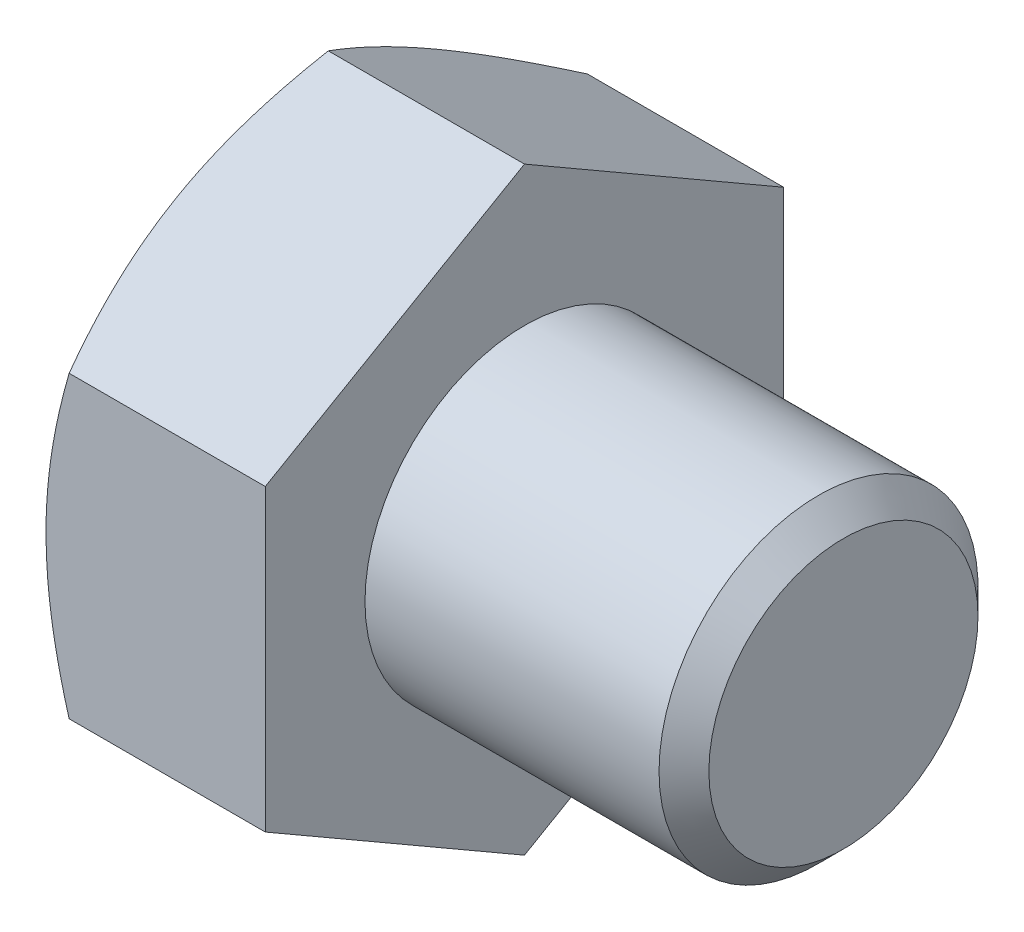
ISO-10303-21;
HEADER;
FILE_DESCRIPTION(('STEP AP214'),'2;1');
FILE_NAME('part.step','',(''),(''),'','','');
FILE_SCHEMA(('AUTOMOTIVE_DESIGN { 1 0 10303 214 1 1 1 1 }'));
ENDSEC;
DATA;
#1=APPLICATION_CONTEXT('core data for automotive mechanical design processes');
#2=APPLICATION_PROTOCOL_DEFINITION('international standard','automotive_design',2000,#1);
#3=PRODUCT_CONTEXT('',#1,'mechanical');
#4=PRODUCT('Part','Part','',(#3));
#5=PRODUCT_RELATED_PRODUCT_CATEGORY('part','',(#4));
#6=PRODUCT_DEFINITION_FORMATION('','',#4);
#7=PRODUCT_DEFINITION_CONTEXT('part definition',#1,'design');
#8=PRODUCT_DEFINITION('design','',#6,#7);
#9=PRODUCT_DEFINITION_SHAPE('','',#8);
#10=(LENGTH_UNIT() NAMED_UNIT(*) SI_UNIT(.MILLI.,.METRE.));
#11=(NAMED_UNIT(*) PLANE_ANGLE_UNIT() SI_UNIT($,.RADIAN.));
#12=(NAMED_UNIT(*) SI_UNIT($,.STERADIAN.) SOLID_ANGLE_UNIT());
#13=UNCERTAINTY_MEASURE_WITH_UNIT(LENGTH_MEASURE(1.E-05),#10,'distance_accuracy_value','');
#14=(GEOMETRIC_REPRESENTATION_CONTEXT(3) GLOBAL_UNCERTAINTY_ASSIGNED_CONTEXT((#13)) GLOBAL_UNIT_ASSIGNED_CONTEXT((#10,
#11,#12)) REPRESENTATION_CONTEXT('',''));
#15=CARTESIAN_POINT('',(0.,0.,0.));
#16=DIRECTION('',(0.,0.,1.));
#17=DIRECTION('',(1.,0.,0.));
#18=AXIS2_PLACEMENT_3D('',#15,#16,#17);
#19=CARTESIAN_POINT('',(0.,7.50555349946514,0.));
#20=DIRECTION('',(1.,0.,0.));
#21=DIRECTION('',(0.,0.,-1.));
#22=AXIS2_PLACEMENT_3D('',#19,#20,#21);
#23=PLANE('',#22);
#24=DIRECTION('',(0.,0.5,0.866025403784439));
#25=VECTOR('',#24,1.);
#26=CARTESIAN_POINT('',(0.,3.75277674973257,-6.5));
#27=LINE('',#26,#25);
#28=CARTESIAN_POINT('',(0.,3.75277674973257,-6.5));
#29=VERTEX_POINT('',#28);
#30=CARTESIAN_POINT('',(0.,7.50555349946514,0.));
#31=VERTEX_POINT('',#30);
#32=EDGE_CURVE('E140',#29,#31,#27,.T.);
#33=ORIENTED_EDGE('',*,*,#32,.T.);
#34=DIRECTION('',(0.,-0.5,0.866025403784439));
#35=VECTOR('',#34,1.);
#36=CARTESIAN_POINT('',(0.,7.50555349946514,0.));
#37=LINE('',#36,#35);
#38=CARTESIAN_POINT('',(0.,3.75277674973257,6.5));
#39=VERTEX_POINT('',#38);
#40=EDGE_CURVE('E284',#31,#39,#37,.T.);
#41=ORIENTED_EDGE('',*,*,#40,.T.);
#42=DIRECTION('',(0.,-1.,0.));
#43=VECTOR('',#42,1.);
#44=CARTESIAN_POINT('',(0.,3.75277674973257,6.5));
#45=LINE('',#44,#43);
#46=CARTESIAN_POINT('',(0.,-3.75277674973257,6.5));
#47=VERTEX_POINT('',#46);
#48=EDGE_CURVE('E288',#39,#47,#45,.T.);
#49=ORIENTED_EDGE('',*,*,#48,.T.);
#50=DIRECTION('',(0.,-0.5,-0.866025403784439));
#51=VECTOR('',#50,1.);
#52=CARTESIAN_POINT('',(0.,-3.75277674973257,6.5));
#53=LINE('',#52,#51);
#54=CARTESIAN_POINT('',(0.,-7.50555349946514,0.));
#55=VERTEX_POINT('',#54);
#56=EDGE_CURVE('E291',#47,#55,#53,.T.);
#57=ORIENTED_EDGE('',*,*,#56,.T.);
#58=DIRECTION('',(0.,0.5,-0.866025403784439));
#59=VECTOR('',#58,1.);
#60=CARTESIAN_POINT('',(0.,-7.50555349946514,0.));
#61=LINE('',#60,#59);
#62=CARTESIAN_POINT('',(0.,-3.75277674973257,-6.5));
#63=VERTEX_POINT('',#62);
#64=EDGE_CURVE('E294',#55,#63,#61,.T.);
#65=ORIENTED_EDGE('',*,*,#64,.T.);
#66=DIRECTION('',(0.,1.,0.));
#67=VECTOR('',#66,1.);
#68=CARTESIAN_POINT('',(0.,-3.75277674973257,-6.5));
#69=LINE('',#68,#67);
#70=EDGE_CURVE('E156',#63,#29,#69,.T.);
#71=ORIENTED_EDGE('',*,*,#70,.T.);
#72=EDGE_LOOP('',(#33,#41,#49,#57,#65,#71));
#73=FACE_BOUND('',#72,.T.);
#74=CARTESIAN_POINT('',(0.,0.,0.));
#75=DIRECTION('',(-1.,0.,0.));
#76=DIRECTION('',(0.,0.,1.));
#77=AXIS2_PLACEMENT_3D('',#74,#75,#76);
#78=CIRCLE('',#77,4.);
#79=CARTESIAN_POINT('',(0.,0.,4.));
#80=VERTEX_POINT('',#79);
#81=EDGE_CURVE('E279',#80,#80,#78,.T.);
#82=ORIENTED_EDGE('',*,*,#81,.T.);
#83=EDGE_LOOP('',(#82));
#84=FACE_BOUND('',#83,.T.);
#85=ADVANCED_FACE('F43',(#73,#84),#23,.T.);
#86=CARTESIAN_POINT('',(-5.5,3.75277674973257,-6.5));
#87=DIRECTION('',(0.,0.866025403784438,-0.5));
#88=DIRECTION('',(0.,0.5,0.866025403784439));
#89=AXIS2_PLACEMENT_3D('',#86,#87,#88);
#90=PLANE('',#89);
#91=CARTESIAN_POINT('',(-4.91937674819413,7.50566896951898,0.000200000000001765));
#92=CARTESIAN_POINT('',(-4.96699557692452,7.4231786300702,-0.142677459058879));
#93=CARTESIAN_POINT('',(-5.01245329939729,7.34038072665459,-0.286087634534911));
#94=CARTESIAN_POINT('',(-5.09845131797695,7.17411251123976,-0.574072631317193));
#95=CARTESIAN_POINT('',(-5.13898949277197,7.09064192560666,-0.718647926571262));
#96=CARTESIAN_POINT('',(-5.25242899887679,6.83889369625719,-1.15468865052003));
#97=CARTESIAN_POINT('',(-5.31695219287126,6.66962231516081,-1.44787528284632));
#98=CARTESIAN_POINT('',(-5.39261341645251,6.41631077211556,-1.88662374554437));
#99=CARTESIAN_POINT('',(-5.41416714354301,6.33302748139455,-2.03087463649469));
#100=CARTESIAN_POINT('',(-5.45030968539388,6.16608458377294,-2.32002821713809));
#101=CARTESIAN_POINT('',(-5.46489911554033,6.08242501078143,-2.46493084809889));
#102=CARTESIAN_POINT('',(-5.48674124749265,5.91496056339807,-2.75498777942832));
#103=CARTESIAN_POINT('',(-5.49400227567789,5.83115596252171,-2.90014160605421));
#104=CARTESIAN_POINT('',(-5.50103969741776,5.66347396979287,-3.19057533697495));
#105=CARTESIAN_POINT('',(-5.50081632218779,5.57959658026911,-3.33585523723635));
#106=CARTESIAN_POINT('',(-5.48991654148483,5.34979921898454,-3.73387594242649));
#107=CARTESIAN_POINT('',(-5.47161818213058,5.20395446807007,-3.98648646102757));
#108=CARTESIAN_POINT('',(-5.41359365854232,4.91323365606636,-4.49002967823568));
#109=CARTESIAN_POINT('',(-5.37384766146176,4.76835861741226,-4.74096060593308));
#110=CARTESIAN_POINT('',(-5.27449409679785,4.47705272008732,-5.24551722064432));
#111=CARTESIAN_POINT('',(-5.21446557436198,4.33065861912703,-5.49907924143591));
#112=CARTESIAN_POINT('',(-5.07822500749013,4.04005357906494,-6.00242193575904));
#113=CARTESIAN_POINT('',(-5.00204496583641,3.89583891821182,-6.25220905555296));
#114=CARTESIAN_POINT('',(-4.91937674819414,3.75266127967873,-6.5002));
#115=B_SPLINE_CURVE_WITH_KNOTS('',3,(#91,#92,#93,#94,#95,#96,#97,#98,#99,#100,#101,#102,#103,
#104,#105,#106,#107,#108,#109,#110,#111,#112,#113,#114),.UNSPECIFIED.,.F.,.F.,(4,2,2,2,2,2,2,2,
2,2,2,4),(0.,0.515105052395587,1.03043143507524,2.06322554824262,2.56697389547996,
3.07067772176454,3.57380860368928,4.0769239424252,4.9527935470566,5.82947446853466,
6.72559912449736,7.61996451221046),.UNSPECIFIED.);
#116=CARTESIAN_POINT('',(-4.91944341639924,7.50555349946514,0.));
#117=VERTEX_POINT('',#116);
#118=CARTESIAN_POINT('',(-5.5,5.62916512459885,-3.25));
#119=VERTEX_POINT('',#118);
#120=EDGE_CURVE('E126',#117,#119,#115,.T.);
#121=ORIENTED_EDGE('',*,*,#120,.F.);
#122=DIRECTION('',(1.,0.,0.));
#123=VECTOR('',#122,1.);
#124=CARTESIAN_POINT('',(-5.5,7.50555349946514,0.));
#125=LINE('',#124,#123);
#126=EDGE_CURVE('E167',#117,#31,#125,.T.);
#127=ORIENTED_EDGE('',*,*,#126,.T.);
#128=ORIENTED_EDGE('',*,*,#32,.F.);
#129=DIRECTION('',(1.,0.,0.));
#130=VECTOR('',#129,1.);
#131=CARTESIAN_POINT('',(-5.5,3.75277674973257,-6.5));
#132=LINE('',#131,#130);
#133=CARTESIAN_POINT('',(-4.91944341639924,3.75277674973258,-6.5));
#134=VERTEX_POINT('',#133);
#135=EDGE_CURVE('E132',#134,#29,#132,.T.);
#136=ORIENTED_EDGE('',*,*,#135,.F.);
#137=EDGE_CURVE('E116',#119,#134,#115,.T.);
#138=ORIENTED_EDGE('',*,*,#137,.F.);
#139=EDGE_LOOP('',(#121,#127,#128,#136,#138));
#140=FACE_BOUND('',#139,.T.);
#141=ADVANCED_FACE('F138',(#140),#90,.T.);
#142=CARTESIAN_POINT('',(-5.5,-3.75277674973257,-6.5));
#143=DIRECTION('',(0.,0.,-1.));
#144=DIRECTION('',(0.,1.,0.));
#145=AXIS2_PLACEMENT_3D('',#142,#143,#144);
#146=PLANE('',#145);
#147=CARTESIAN_POINT('',(-2.38957529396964,-9.95291930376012,-6.5));
#148=CARTESIAN_POINT('',(-2.52748998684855,-9.66753246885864,-6.5));
#149=CARTESIAN_POINT('',(-2.66403369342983,-9.38147088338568,-6.5));
#150=CARTESIAN_POINT('',(-2.93359570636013,-8.80763337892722,-6.5));
#151=CARTESIAN_POINT('',(-3.06661340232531,-8.51985717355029,-6.5));
#152=CARTESIAN_POINT('',(-3.32904071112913,-7.94067105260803,-6.5));
#153=CARTESIAN_POINT('',(-3.45842532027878,-7.64924976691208,-6.5));
#154=CARTESIAN_POINT('',(-3.7116371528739,-7.06401195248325,-6.5));
#155=CARTESIAN_POINT('',(-3.8354646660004,-6.77019554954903,-6.5));
#156=CARTESIAN_POINT('',(-4.07755469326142,-6.17605277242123,-6.5));
#157=CARTESIAN_POINT('',(-4.19573022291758,-5.87569076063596,-6.5));
#158=CARTESIAN_POINT('',(-4.42282573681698,-5.27142371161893,-6.5));
#159=CARTESIAN_POINT('',(-4.53174469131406,-4.96751828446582,-6.5));
#160=CARTESIAN_POINT('',(-4.73740073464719,-4.35630617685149,-6.5));
#161=CARTESIAN_POINT('',(-4.83416372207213,-4.04900829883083,-6.5));
#162=CARTESIAN_POINT('',(-5.01236415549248,-3.43004071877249,-6.5));
#163=CARTESIAN_POINT('',(-5.09380644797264,-3.11837243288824,-6.5));
#164=CARTESIAN_POINT('',(-5.23741588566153,-2.49046612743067,-6.5));
#165=CARTESIAN_POINT('',(-5.29957789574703,-2.17422691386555,-6.5));
#166=CARTESIAN_POINT('',(-5.40042581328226,-1.53789143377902,-6.5));
#167=CARTESIAN_POINT('',(-5.43911169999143,-1.21779516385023,-6.5));
#168=CARTESIAN_POINT('',(-5.47705347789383,-0.737141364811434,-6.5));
#169=CARTESIAN_POINT('',(-5.48635482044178,-0.577336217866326,-6.5));
#170=CARTESIAN_POINT('',(-5.49818593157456,-0.257468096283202,-6.5));
#171=CARTESIAN_POINT('',(-5.50071578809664,-0.0974051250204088,-6.5));
#172=CARTESIAN_POINT('',(-5.49893596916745,0.222636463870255,-6.5));
#173=CARTESIAN_POINT('',(-5.49462821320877,0.382615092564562,-6.5));
#174=CARTESIAN_POINT('',(-5.47928234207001,0.702251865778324,-6.5));
#175=CARTESIAN_POINT('',(-5.46824389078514,0.861909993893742,-6.5));
#176=CARTESIAN_POINT('',(-5.43356297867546,1.24887194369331,-6.5));
#177=CARTESIAN_POINT('',(-5.40654793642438,1.47587839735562,-6.5));
#178=CARTESIAN_POINT('',(-5.34040986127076,1.92815183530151,-6.5));
#179=CARTESIAN_POINT('',(-5.30128352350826,2.15341832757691,-6.5));
#180=CARTESIAN_POINT('',(-5.21231047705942,2.60202592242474,-6.5));
#181=CARTESIAN_POINT('',(-5.16245363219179,2.82536499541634,-6.5));
#182=CARTESIAN_POINT('',(-5.05354078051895,3.26974530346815,-6.5));
#183=CARTESIAN_POINT('',(-4.99448564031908,3.49078675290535,-6.5));
#184=CARTESIAN_POINT('',(-4.86704532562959,3.93601601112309,-6.5));
#185=CARTESIAN_POINT('',(-4.79846693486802,4.16014813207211,-6.5));
#186=CARTESIAN_POINT('',(-4.65453421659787,4.60604329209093,-6.5));
#187=CARTESIAN_POINT('',(-4.5791845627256,4.82780784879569,-6.5));
#188=CARTESIAN_POINT('',(-4.42326573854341,5.26807801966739,-6.5));
#189=CARTESIAN_POINT('',(-4.34272833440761,5.48659495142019,-6.5));
#190=CARTESIAN_POINT('',(-4.17692644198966,5.92193342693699,-6.5));
#191=CARTESIAN_POINT('',(-4.09166004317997,6.13875424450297,-6.5));
#192=CARTESIAN_POINT('',(-4.00449694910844,6.35478737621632,-6.5));
#193=B_SPLINE_CURVE_WITH_KNOTS('',3,(#147,#148,#149,#150,#151,#152,#153,#154,#155,#156,#157,
#158,#159,#160,#161,#162,#163,#164,#165,#166,#167,#168,#169,#170,#171,#172,#173,#174,#175,#176,
#177,#178,#179,#180,#181,#182,#183,#184,#185,#186,#187,#188,#189,#190,#191,#192),.UNSPECIFIED.,
.F.,.F.,(4,2,2,2,2,2,2,2,2,2,2,2,2,2,2,2,2,2,2,2,2,2,4),(0.,0.950904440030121,1.90197242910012,
2.85848299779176,3.81494364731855,4.78314666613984,5.75145725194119,6.71766851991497,
7.68357362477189,8.64973576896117,9.61589876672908,10.0960037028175,10.5761024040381,
11.0560663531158,11.5360542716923,12.2214972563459,12.9071274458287,13.5934081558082,
14.2796242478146,14.9826609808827,15.685216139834,16.3838168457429,17.0827018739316),.UNSPECIFIED.);
#194=CARTESIAN_POINT('',(-5.5,0.,-6.5));
#195=VERTEX_POINT('',#194);
#196=EDGE_CURVE('E119',#134,#195,#193,.F.);
#197=ORIENTED_EDGE('',*,*,#196,.F.);
#198=ORIENTED_EDGE('',*,*,#135,.T.);
#199=ORIENTED_EDGE('',*,*,#70,.F.);
#200=DIRECTION('',(1.,0.,0.));
#201=VECTOR('',#200,1.);
#202=CARTESIAN_POINT('',(-5.5,-3.75277674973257,-6.5));
#203=LINE('',#202,#201);
#204=CARTESIAN_POINT('',(-4.91944341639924,-3.75277674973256,-6.50000000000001));
#205=VERTEX_POINT('',#204);
#206=EDGE_CURVE('E144',#205,#63,#203,.T.);
#207=ORIENTED_EDGE('',*,*,#206,.F.);
#208=EDGE_CURVE('E135',#195,#205,#193,.F.);
#209=ORIENTED_EDGE('',*,*,#208,.F.);
#210=EDGE_LOOP('',(#197,#198,#199,#207,#209));
#211=FACE_BOUND('',#210,.T.);
#212=ADVANCED_FACE('F130',(#211),#146,.T.);
#213=CARTESIAN_POINT('',(-5.5,-7.50555349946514,0.));
#214=DIRECTION('',(0.,-0.866025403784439,-0.5));
#215=DIRECTION('',(0.,0.5,-0.866025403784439));
#216=AXIS2_PLACEMENT_3D('',#213,#214,#215);
#217=PLANE('',#216);
#218=CARTESIAN_POINT('',(-4.91937674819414,-3.75266127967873,-6.5002));
#219=CARTESIAN_POINT('',(-4.96699557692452,-3.83515161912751,-6.35732254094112));
#220=CARTESIAN_POINT('',(-5.0124532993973,-3.91794952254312,-6.21391236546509));
#221=CARTESIAN_POINT('',(-5.09845131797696,-4.08421773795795,-5.9259273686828));
#222=CARTESIAN_POINT('',(-5.13898949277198,-4.16768832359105,-5.78135207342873));
#223=CARTESIAN_POINT('',(-5.25242899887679,-4.41943655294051,-5.34531134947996));
#224=CARTESIAN_POINT('',(-5.31695219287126,-4.5887079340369,-5.05212471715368));
#225=CARTESIAN_POINT('',(-5.39261341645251,-4.84201947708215,-4.61337625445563));
#226=CARTESIAN_POINT('',(-5.41416714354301,-4.92530276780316,-4.46912536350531));
#227=CARTESIAN_POINT('',(-5.45030968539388,-5.09224566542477,-4.17997178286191));
#228=CARTESIAN_POINT('',(-5.46489911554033,-5.17590523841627,-4.03506915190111));
#229=CARTESIAN_POINT('',(-5.48674124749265,-5.34336968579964,-3.74501222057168));
#230=CARTESIAN_POINT('',(-5.49400227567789,-5.427174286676,-3.59985839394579));
#231=CARTESIAN_POINT('',(-5.50103969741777,-5.59485627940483,-3.30942466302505));
#232=CARTESIAN_POINT('',(-5.50081632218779,-5.6787336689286,-3.16414476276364));
#233=CARTESIAN_POINT('',(-5.48991654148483,-5.90853103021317,-2.76612405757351));
#234=CARTESIAN_POINT('',(-5.47161818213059,-6.05437578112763,-2.51351353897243));
#235=CARTESIAN_POINT('',(-5.41359365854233,-6.34509659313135,-2.00997032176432));
#236=CARTESIAN_POINT('',(-5.37384766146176,-6.48997163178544,-1.75903939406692));
#237=CARTESIAN_POINT('',(-5.27449409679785,-6.78127752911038,-1.25448277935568));
#238=CARTESIAN_POINT('',(-5.21446557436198,-6.92767163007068,-1.00092075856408));
#239=CARTESIAN_POINT('',(-5.07822500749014,-7.21827667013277,-0.497578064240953));
#240=CARTESIAN_POINT('',(-5.00204496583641,-7.36249133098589,-0.247790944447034));
#241=CARTESIAN_POINT('',(-4.91937674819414,-7.50566896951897,0.000200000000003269));
#242=B_SPLINE_CURVE_WITH_KNOTS('',3,(#218,#219,#220,#221,#222,#223,#224,#225,#226,#227,#228,
#229,#230,#231,#232,#233,#234,#235,#236,#237,#238,#239,#240,#241),.UNSPECIFIED.,.F.,.F.,(4,2,2,
2,2,2,2,2,2,2,2,4),(0.,0.515105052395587,1.03043143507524,2.06322554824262,2.56697389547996,
3.07067772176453,3.57380860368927,4.07692394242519,4.9527935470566,5.82947446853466,
6.72559912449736,7.61996451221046),.UNSPECIFIED.);
#243=CARTESIAN_POINT('',(-5.5,-5.62916512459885,-3.25));
#244=VERTEX_POINT('',#243);
#245=EDGE_CURVE('E253',#205,#244,#242,.T.);
#246=ORIENTED_EDGE('',*,*,#245,.F.);
#247=ORIENTED_EDGE('',*,*,#206,.T.);
#248=ORIENTED_EDGE('',*,*,#64,.F.);
#249=DIRECTION('',(1.,0.,0.));
#250=VECTOR('',#249,1.);
#251=CARTESIAN_POINT('',(-5.5,-7.50555349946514,0.));
#252=LINE('',#251,#250);
#253=CARTESIAN_POINT('',(-4.91944341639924,-7.50555349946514,0.));
#254=VERTEX_POINT('',#253);
#255=EDGE_CURVE('E153',#254,#55,#252,.T.);
#256=ORIENTED_EDGE('',*,*,#255,.F.);
#257=EDGE_CURVE('E204',#244,#254,#242,.T.);
#258=ORIENTED_EDGE('',*,*,#257,.F.);
#259=EDGE_LOOP('',(#246,#247,#248,#256,#258));
#260=FACE_BOUND('',#259,.T.);
#261=ADVANCED_FACE('F262',(#260),#217,.T.);
#262=CARTESIAN_POINT('',(-5.5,-3.75277674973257,6.5));
#263=DIRECTION('',(0.,-0.866025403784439,0.5));
#264=DIRECTION('',(0.,-0.5,-0.866025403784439));
#265=AXIS2_PLACEMENT_3D('',#262,#263,#264);
#266=PLANE('',#265);
#267=CARTESIAN_POINT('',(-4.91937674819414,-7.50566896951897,-0.000199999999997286));
#268=CARTESIAN_POINT('',(-4.96699557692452,-7.4231786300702,0.142677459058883));
#269=CARTESIAN_POINT('',(-5.0124532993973,-7.34038072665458,0.286087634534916));
#270=CARTESIAN_POINT('',(-5.09845131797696,-7.17411251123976,0.574072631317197));
#271=CARTESIAN_POINT('',(-5.13898949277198,-7.09064192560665,0.718647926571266));
#272=CARTESIAN_POINT('',(-5.25242899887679,-6.83889369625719,1.15468865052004));
#273=CARTESIAN_POINT('',(-5.31695219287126,-6.66962231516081,1.44787528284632));
#274=CARTESIAN_POINT('',(-5.39261341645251,-6.41631077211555,1.88662374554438));
#275=CARTESIAN_POINT('',(-5.41416714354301,-6.33302748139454,2.03087463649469));
#276=CARTESIAN_POINT('',(-5.45030968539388,-6.16608458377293,2.32002821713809));
#277=CARTESIAN_POINT('',(-5.46489911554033,-6.08242501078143,2.46493084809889));
#278=CARTESIAN_POINT('',(-5.48674124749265,-5.91496056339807,2.75498777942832));
#279=CARTESIAN_POINT('',(-5.49400227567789,-5.8311559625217,2.90014160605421));
#280=CARTESIAN_POINT('',(-5.50103969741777,-5.66347396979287,3.19057533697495));
#281=CARTESIAN_POINT('',(-5.50081632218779,-5.5795965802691,3.33585523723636));
#282=CARTESIAN_POINT('',(-5.48991654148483,-5.34979921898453,3.73387594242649));
#283=CARTESIAN_POINT('',(-5.47161818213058,-5.20395446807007,3.98648646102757));
#284=CARTESIAN_POINT('',(-5.41359365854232,-4.91323365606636,4.49002967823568));
#285=CARTESIAN_POINT('',(-5.37384766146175,-4.76835861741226,4.74096060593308));
#286=CARTESIAN_POINT('',(-5.27449409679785,-4.47705272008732,5.24551722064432));
#287=CARTESIAN_POINT('',(-5.21446557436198,-4.33065861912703,5.49907924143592));
#288=CARTESIAN_POINT('',(-5.07822500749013,-4.04005357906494,6.00242193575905));
#289=CARTESIAN_POINT('',(-5.00204496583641,-3.89583891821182,6.25220905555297));
#290=CARTESIAN_POINT('',(-4.91937674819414,-3.75266127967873,6.5002));
#291=B_SPLINE_CURVE_WITH_KNOTS('',3,(#267,#268,#269,#270,#271,#272,#273,#274,#275,#276,#277,
#278,#279,#280,#281,#282,#283,#284,#285,#286,#287,#288,#289,#290),.UNSPECIFIED.,.F.,.F.,(4,2,2,
2,2,2,2,2,2,2,2,4),(0.,0.515105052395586,1.03043143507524,2.06322554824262,2.56697389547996,
3.07067772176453,3.57380860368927,4.0769239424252,4.9527935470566,5.82947446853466,
6.72559912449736,7.61996451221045),.UNSPECIFIED.);
#292=CARTESIAN_POINT('',(-5.5,-5.62916512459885,3.25));
#293=VERTEX_POINT('',#292);
#294=EDGE_CURVE('E194',#254,#293,#291,.T.);
#295=ORIENTED_EDGE('',*,*,#294,.F.);
#296=ORIENTED_EDGE('',*,*,#255,.T.);
#297=ORIENTED_EDGE('',*,*,#56,.F.);
#298=DIRECTION('',(1.,0.,0.));
#299=VECTOR('',#298,1.);
#300=CARTESIAN_POINT('',(-5.5,-3.75277674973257,6.5));
#301=LINE('',#300,#299);
#302=CARTESIAN_POINT('',(-4.91944341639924,-3.75277674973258,6.5));
#303=VERTEX_POINT('',#302);
#304=EDGE_CURVE('E161',#303,#47,#301,.T.);
#305=ORIENTED_EDGE('',*,*,#304,.F.);
#306=EDGE_CURVE('E192',#293,#303,#291,.T.);
#307=ORIENTED_EDGE('',*,*,#306,.F.);
#308=EDGE_LOOP('',(#295,#296,#297,#305,#307));
#309=FACE_BOUND('',#308,.T.);
#310=ADVANCED_FACE('F193',(#309),#266,.T.);
#311=CARTESIAN_POINT('',(-5.5,3.75277674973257,6.5));
#312=DIRECTION('',(0.,0.,1.));
#313=DIRECTION('',(0.,-1.,0.));
#314=AXIS2_PLACEMENT_3D('',#311,#312,#313);
#315=PLANE('',#314);
#316=CARTESIAN_POINT('',(-2.38957641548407,-9.95291698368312,6.5));
#317=CARTESIAN_POINT('',(-2.52749106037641,-9.66753022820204,6.5));
#318=CARTESIAN_POINT('',(-2.66403471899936,-9.38146872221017,6.5));
#319=CARTESIAN_POINT('',(-2.9335966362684,-8.80763137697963,6.5));
#320=CARTESIAN_POINT('',(-3.0666142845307,-8.51985525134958,6.5));
#321=CARTESIAN_POINT('',(-3.3290414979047,-7.94066929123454,6.5));
#322=CARTESIAN_POINT('',(-3.45842605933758,-7.64924808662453,6.5));
#323=CARTESIAN_POINT('',(-3.7116377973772,-7.06401043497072,6.5));
#324=CARTESIAN_POINT('',(-3.8354652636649,-6.77019411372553,6.5));
#325=CARTESIAN_POINT('',(-4.07755519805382,-6.17605150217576,6.5));
#326=CARTESIAN_POINT('',(-4.19573068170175,-5.87568957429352,6.5));
#327=CARTESIAN_POINT('',(-4.42282610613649,-5.27142269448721,6.5));
#328=CARTESIAN_POINT('',(-4.53174501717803,-4.96751735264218,6.5));
#329=CARTESIAN_POINT('',(-4.73740097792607,-4.3563054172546,6.5));
#330=CARTESIAN_POINT('',(-4.83416392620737,-4.04900762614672,6.5));
#331=CARTESIAN_POINT('',(-5.01236428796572,-3.43004022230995,6.5));
#332=CARTESIAN_POINT('',(-5.09380654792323,-3.11837202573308,6.5));
#333=CARTESIAN_POINT('',(-5.23741591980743,-2.49046594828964,6.5));
#334=CARTESIAN_POINT('',(-5.29957789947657,-2.17422687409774,6.5));
#335=CARTESIAN_POINT('',(-5.40042577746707,-1.5378916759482,6.5));
#336=CARTESIAN_POINT('',(-5.43911165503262,-1.21779554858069,6.5));
#337=CARTESIAN_POINT('',(-5.477053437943,-0.737141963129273,6.5));
#338=CARTESIAN_POINT('',(-5.48635478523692,-0.577336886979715,6.5));
#339=CARTESIAN_POINT('',(-5.49818591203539,-0.257468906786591,6.5));
#340=CARTESIAN_POINT('',(-5.50071577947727,-0.0974060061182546,6.5));
#341=CARTESIAN_POINT('',(-5.49893598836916,0.222635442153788,6.5));
#342=CARTESIAN_POINT('',(-5.49462824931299,0.382614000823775,6.5));
#343=CARTESIAN_POINT('',(-5.47928241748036,0.702250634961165,6.5));
#344=CARTESIAN_POINT('',(-5.46824398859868,0.861908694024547,6.5));
#345=CARTESIAN_POINT('',(-5.43356313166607,1.24887053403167,6.5));
#346=CARTESIAN_POINT('',(-5.40654812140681,1.47587694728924,6.5));
#347=CARTESIAN_POINT('',(-5.34041011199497,1.928150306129,6.5));
#348=CARTESIAN_POINT('',(-5.30128380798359,2.15341675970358,6.5));
#349=CARTESIAN_POINT('',(-5.21231082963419,2.60202427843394,6.5));
#350=CARTESIAN_POINT('',(-5.16245401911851,2.8253633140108,6.5));
#351=CARTESIAN_POINT('',(-5.05354123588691,3.2697435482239,6.5));
#352=CARTESIAN_POINT('',(-4.9944861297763,3.490784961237,6.5));
#353=CARTESIAN_POINT('',(-4.8670458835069,3.93601414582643,6.5));
#354=CARTESIAN_POINT('',(-4.79846752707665,4.16014622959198,6.5));
#355=CARTESIAN_POINT('',(-4.65453487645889,4.60604131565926,6.5));
#356=CARTESIAN_POINT('',(-4.57918525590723,4.82780583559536,6.5));
#357=CARTESIAN_POINT('',(-4.42326649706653,5.26807593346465,6.5));
#358=CARTESIAN_POINT('',(-4.34272912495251,5.48659282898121,6.5));
#359=CARTESIAN_POINT('',(-4.1769272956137,5.92193123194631,6.5));
#360=CARTESIAN_POINT('',(-4.09166092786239,6.13875201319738,6.5));
#361=CARTESIAN_POINT('',(-4.00449786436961,6.35478510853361,6.5));
#362=B_SPLINE_CURVE_WITH_KNOTS('',3,(#316,#317,#318,#319,#320,#321,#322,#323,#324,#325,#326,
#327,#328,#329,#330,#331,#332,#333,#334,#335,#336,#337,#338,#339,#340,#341,#342,#343,#344,#345,
#346,#347,#348,#349,#350,#351,#352,#353,#354,#355,#356,#357,#358,#359,#360,#361),.UNSPECIFIED.,
.F.,.F.,(4,2,2,2,2,2,2,2,2,2,2,2,2,2,2,2,2,2,2,2,2,2,4),(0.,0.95090416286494,1.90197187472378,
2.85848216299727,3.81494253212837,4.78314526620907,5.7514555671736,6.71766655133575,
7.68357137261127,8.64973308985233,9.61589566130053,10.0960003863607,10.5760988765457,
11.0560626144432,11.5360503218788,12.2214931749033,12.9071232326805,13.5934038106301,
14.2796197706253,14.9826563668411,15.6852113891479,16.3838119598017,17.0826968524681),.UNSPECIFIED.);
#363=CARTESIAN_POINT('',(-5.5,0.,6.5));
#364=VERTEX_POINT('',#363);
#365=EDGE_CURVE('E200',#303,#364,#362,.T.);
#366=ORIENTED_EDGE('',*,*,#365,.F.);
#367=ORIENTED_EDGE('',*,*,#304,.T.);
#368=ORIENTED_EDGE('',*,*,#48,.F.);
#369=DIRECTION('',(1.,0.,0.));
#370=VECTOR('',#369,1.);
#371=CARTESIAN_POINT('',(-5.5,3.75277674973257,6.5));
#372=LINE('',#371,#370);
#373=CARTESIAN_POINT('',(-4.91944341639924,3.75277674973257,6.5));
#374=VERTEX_POINT('',#373);
#375=EDGE_CURVE('E164',#374,#39,#372,.T.);
#376=ORIENTED_EDGE('',*,*,#375,.F.);
#377=EDGE_CURVE('E205',#364,#374,#362,.T.);
#378=ORIENTED_EDGE('',*,*,#377,.F.);
#379=EDGE_LOOP('',(#366,#367,#368,#376,#378));
#380=FACE_BOUND('',#379,.T.);
#381=ADVANCED_FACE('F269',(#380),#315,.T.);
#382=CARTESIAN_POINT('',(-5.5,7.50555349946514,0.));
#383=DIRECTION('',(0.,0.866025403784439,0.5));
#384=DIRECTION('',(0.,-0.5,0.866025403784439));
#385=AXIS2_PLACEMENT_3D('',#382,#383,#384);
#386=PLANE('',#385);
#387=CARTESIAN_POINT('',(-4.91937674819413,3.75266127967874,6.5002));
#388=CARTESIAN_POINT('',(-4.96699557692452,3.83515161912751,6.35732254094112));
#389=CARTESIAN_POINT('',(-5.01245329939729,3.91794952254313,6.21391236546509));
#390=CARTESIAN_POINT('',(-5.09845131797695,4.08421773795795,5.92592736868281));
#391=CARTESIAN_POINT('',(-5.13898949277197,4.16768832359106,5.78135207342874));
#392=CARTESIAN_POINT('',(-5.25242899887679,4.41943655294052,5.34531134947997));
#393=CARTESIAN_POINT('',(-5.31695219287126,4.5887079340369,5.05212471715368));
#394=CARTESIAN_POINT('',(-5.39261341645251,4.84201947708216,4.61337625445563));
#395=CARTESIAN_POINT('',(-5.41416714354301,4.92530276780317,4.46912536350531));
#396=CARTESIAN_POINT('',(-5.45030968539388,5.09224566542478,4.17997178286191));
#397=CARTESIAN_POINT('',(-5.46489911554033,5.17590523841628,4.03506915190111));
#398=CARTESIAN_POINT('',(-5.48674124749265,5.34336968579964,3.74501222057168));
#399=CARTESIAN_POINT('',(-5.49400227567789,5.427174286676,3.59985839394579));
#400=CARTESIAN_POINT('',(-5.50103969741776,5.59485627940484,3.30942466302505));
#401=CARTESIAN_POINT('',(-5.50081632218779,5.67873366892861,3.16414476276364));
#402=CARTESIAN_POINT('',(-5.48991654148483,5.90853103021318,2.76612405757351));
#403=CARTESIAN_POINT('',(-5.47161818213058,6.05437578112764,2.51351353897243));
#404=CARTESIAN_POINT('',(-5.41359365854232,6.34509659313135,2.00997032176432));
#405=CARTESIAN_POINT('',(-5.37384766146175,6.48997163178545,1.75903939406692));
#406=CARTESIAN_POINT('',(-5.27449409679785,6.78127752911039,1.25448277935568));
#407=CARTESIAN_POINT('',(-5.21446557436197,6.92767163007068,1.00092075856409));
#408=CARTESIAN_POINT('',(-5.07822500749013,7.21827667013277,0.497578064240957));
#409=CARTESIAN_POINT('',(-5.00204496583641,7.36249133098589,0.247790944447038));
#410=CARTESIAN_POINT('',(-4.91937674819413,7.50566896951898,-0.00019999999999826));
#411=B_SPLINE_CURVE_WITH_KNOTS('',3,(#387,#388,#389,#390,#391,#392,#393,#394,#395,#396,#397,
#398,#399,#400,#401,#402,#403,#404,#405,#406,#407,#408,#409,#410),.UNSPECIFIED.,.F.,.F.,(4,2,2,
2,2,2,2,2,2,2,2,4),(0.,0.515105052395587,1.03043143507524,2.06322554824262,2.56697389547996,
3.07067772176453,3.57380860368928,4.0769239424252,4.9527935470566,5.82947446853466,
6.72559912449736,7.61996451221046),.UNSPECIFIED.);
#412=CARTESIAN_POINT('',(-5.5,5.62916512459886,3.25));
#413=VERTEX_POINT('',#412);
#414=EDGE_CURVE('E305',#374,#413,#411,.T.);
#415=ORIENTED_EDGE('',*,*,#414,.F.);
#416=ORIENTED_EDGE('',*,*,#375,.T.);
#417=ORIENTED_EDGE('',*,*,#40,.F.);
#418=ORIENTED_EDGE('',*,*,#126,.F.);
#419=EDGE_CURVE('E237',#413,#117,#411,.T.);
#420=ORIENTED_EDGE('',*,*,#419,.F.);
#421=EDGE_LOOP('',(#415,#416,#417,#418,#420));
#422=FACE_BOUND('',#421,.T.);
#423=ADVANCED_FACE('F310',(#422),#386,.T.);
#424=CARTESIAN_POINT('',(0.,0.,0.));
#425=DIRECTION('',(-1.,0.,0.));
#426=DIRECTION('',(0.,0.,1.));
#427=AXIS2_PLACEMENT_3D('',#424,#425,#426);
#428=CYLINDRICAL_SURFACE('',#427,4.);
#429=CARTESIAN_POINT('',(7.375,0.,0.));
#430=DIRECTION('',(-1.,0.,0.));
#431=DIRECTION('',(0.,0.,1.));
#432=AXIS2_PLACEMENT_3D('',#429,#430,#431);
#433=CIRCLE('',#432,4.);
#434=CARTESIAN_POINT('',(7.375,0.,4.));
#435=VERTEX_POINT('',#434);
#436=EDGE_CURVE('E143',#435,#435,#433,.T.);
#437=ORIENTED_EDGE('',*,*,#436,.T.);
#438=EDGE_LOOP('',(#437));
#439=FACE_BOUND('',#438,.T.);
#440=ORIENTED_EDGE('',*,*,#81,.F.);
#441=EDGE_LOOP('',(#440));
#442=FACE_BOUND('',#441,.T.);
#443=ADVANCED_FACE('F318',(#439,#442),#428,.T.);
#444=CARTESIAN_POINT('',(8.00000000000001,0.,-4.));
#445=DIRECTION('',(-1.,0.,0.));
#446=DIRECTION('',(0.,0.,1.));
#447=AXIS2_PLACEMENT_3D('',#444,#445,#446);
#448=PLANE('',#447);
#449=CARTESIAN_POINT('',(8.00000000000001,0.,0.));
#450=DIRECTION('',(-1.,0.,0.));
#451=DIRECTION('',(0.,0.,1.));
#452=AXIS2_PLACEMENT_3D('',#449,#450,#451);
#453=CIRCLE('',#452,3.37499999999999);
#454=CARTESIAN_POINT('',(8.00000000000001,0.,3.37499999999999));
#455=VERTEX_POINT('',#454);
#456=EDGE_CURVE('E150',#455,#455,#453,.F.);
#457=ORIENTED_EDGE('',*,*,#456,.T.);
#458=EDGE_LOOP('',(#457));
#459=FACE_BOUND('',#458,.T.);
#460=ADVANCED_FACE('F233',(#459),#448,.F.);
#461=CARTESIAN_POINT('',(7.375,0.,0.));
#462=DIRECTION('',(-1.,0.,0.));
#463=DIRECTION('',(0.,0.,1.));
#464=AXIS2_PLACEMENT_3D('',#461,#462,#463);
#465=CONICAL_SURFACE('',#464,4.,0.785398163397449);
#466=ORIENTED_EDGE('',*,*,#456,.F.);
#467=EDGE_LOOP('',(#466));
#468=FACE_BOUND('',#467,.T.);
#469=ORIENTED_EDGE('',*,*,#436,.F.);
#470=EDGE_LOOP('',(#469));
#471=FACE_BOUND('',#470,.T.);
#472=ADVANCED_FACE('F45',(#468,#471),#465,.T.);
#473=CARTESIAN_POINT('',(-5.5,0.,0.));
#474=DIRECTION('',(1.,0.,0.));
#475=DIRECTION('',(0.,0.,-1.));
#476=AXIS2_PLACEMENT_3D('',#473,#474,#475);
#477=CONICAL_SURFACE('',#476,6.5,1.0471975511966);
#478=ORIENTED_EDGE('',*,*,#137,.T.);
#479=ORIENTED_EDGE('',*,*,#196,.T.);
#480=CARTESIAN_POINT('',(-5.5,0.,0.));
#481=DIRECTION('',(1.,0.,0.));
#482=DIRECTION('',(0.,0.,-1.));
#483=AXIS2_PLACEMENT_3D('',#480,#481,#482);
#484=CIRCLE('',#483,6.5);
#485=EDGE_CURVE('E121',#195,#119,#484,.T.);
#486=ORIENTED_EDGE('',*,*,#485,.T.);
#487=EDGE_LOOP('',(#478,#479,#486));
#488=FACE_BOUND('',#487,.T.);
#489=ADVANCED_FACE('F118',(#488),#477,.T.);
#490=ORIENTED_EDGE('',*,*,#120,.T.);
#491=CARTESIAN_POINT('',(-5.5,0.,0.));
#492=DIRECTION('',(1.,0.,0.));
#493=DIRECTION('',(0.,0.,-1.));
#494=AXIS2_PLACEMENT_3D('',#491,#492,#493);
#495=CIRCLE('',#494,6.5);
#496=EDGE_CURVE('E53',#413,#119,#495,.F.);
#497=ORIENTED_EDGE('',*,*,#496,.F.);
#498=ORIENTED_EDGE('',*,*,#419,.T.);
#499=EDGE_LOOP('',(#490,#497,#498));
#500=FACE_BOUND('',#499,.T.);
#501=ADVANCED_FACE('F231',(#500),#477,.T.);
#502=ORIENTED_EDGE('',*,*,#377,.T.);
#503=ORIENTED_EDGE('',*,*,#414,.T.);
#504=EDGE_CURVE('E66',#364,#413,#495,.F.);
#505=ORIENTED_EDGE('',*,*,#504,.F.);
#506=EDGE_LOOP('',(#502,#503,#505));
#507=FACE_BOUND('',#506,.T.);
#508=ADVANCED_FACE('F226',(#507),#477,.T.);
#509=ORIENTED_EDGE('',*,*,#306,.T.);
#510=ORIENTED_EDGE('',*,*,#365,.T.);
#511=EDGE_CURVE('E177',#293,#364,#495,.F.);
#512=ORIENTED_EDGE('',*,*,#511,.F.);
#513=EDGE_LOOP('',(#509,#510,#512));
#514=FACE_BOUND('',#513,.T.);
#515=ADVANCED_FACE('F230',(#514),#477,.T.);
#516=ORIENTED_EDGE('',*,*,#257,.T.);
#517=ORIENTED_EDGE('',*,*,#294,.T.);
#518=EDGE_CURVE('E52',#244,#293,#495,.F.);
#519=ORIENTED_EDGE('',*,*,#518,.F.);
#520=EDGE_LOOP('',(#516,#517,#519));
#521=FACE_BOUND('',#520,.T.);
#522=ADVANCED_FACE('F301',(#521),#477,.T.);
#523=ORIENTED_EDGE('',*,*,#208,.T.);
#524=ORIENTED_EDGE('',*,*,#245,.T.);
#525=EDGE_CURVE('E11',#195,#244,#495,.F.);
#526=ORIENTED_EDGE('',*,*,#525,.F.);
#527=EDGE_LOOP('',(#523,#524,#526));
#528=FACE_BOUND('',#527,.T.);
#529=ADVANCED_FACE('F328',(#528),#477,.T.);
#530=CARTESIAN_POINT('',(-5.5,7.50555349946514,0.));
#531=DIRECTION('',(1.,0.,0.));
#532=DIRECTION('',(0.,0.,-1.));
#533=AXIS2_PLACEMENT_3D('',#530,#531,#532);
#534=PLANE('',#533);
#535=ORIENTED_EDGE('',*,*,#485,.F.);
#536=ORIENTED_EDGE('',*,*,#525,.T.);
#537=ORIENTED_EDGE('',*,*,#518,.T.);
#538=ORIENTED_EDGE('',*,*,#511,.T.);
#539=ORIENTED_EDGE('',*,*,#504,.T.);
#540=ORIENTED_EDGE('',*,*,#496,.T.);
#541=EDGE_LOOP('',(#535,#536,#537,#538,#539,#540));
#542=FACE_BOUND('',#541,.T.);
#543=ADVANCED_FACE('F186',(#542),#534,.F.);
#544=CLOSED_SHELL('',(#85,#141,#212,#261,#310,#381,#423,#443,#460,#472,#489,#501,#508,#515,#522,
#529,#543));
#545=MANIFOLD_SOLID_BREP('B2',#544);
#546=ADVANCED_BREP_SHAPE_REPRESENTATION('',(#18,#545),#14);
#547=SHAPE_DEFINITION_REPRESENTATION(#9,#546);
ENDSEC;
END-ISO-10303-21;
